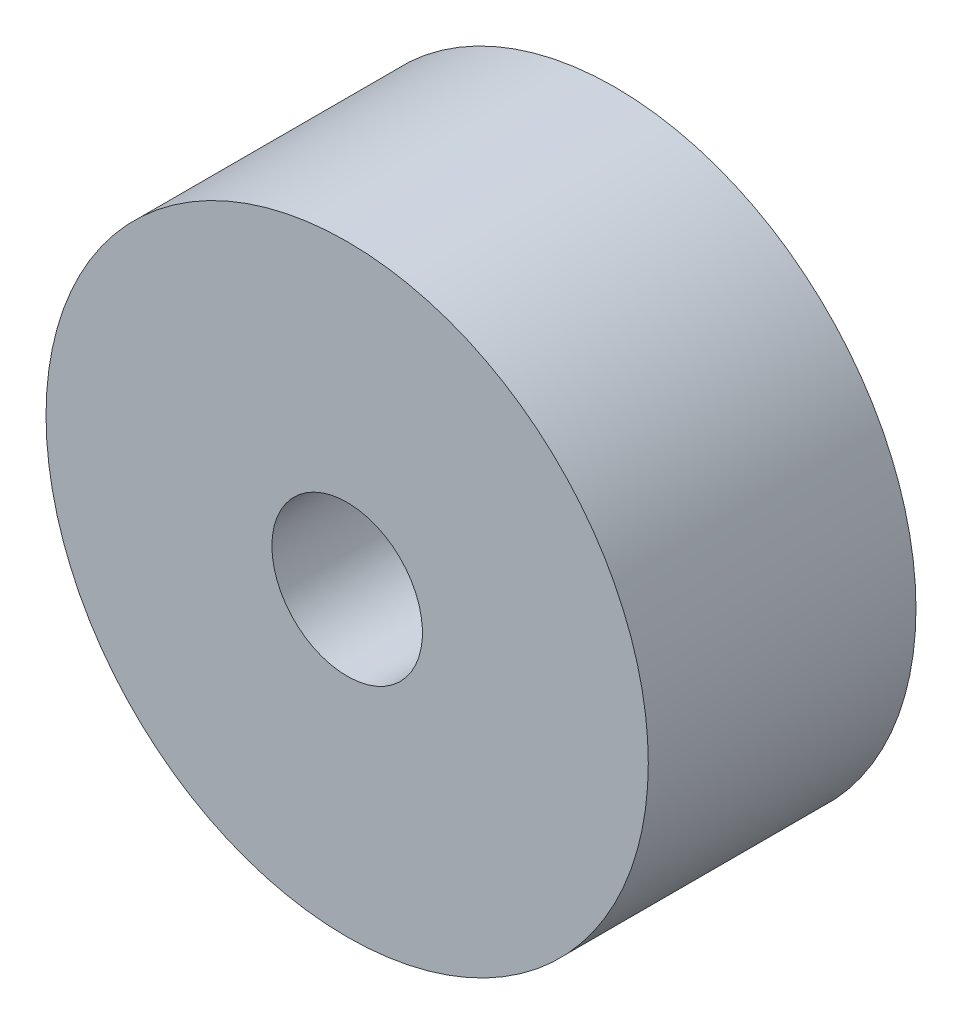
ISO-10303-21;
HEADER;
FILE_DESCRIPTION(('STEP AP214'),'2;1');
FILE_NAME('part.step','',(''),(''),'','','');
FILE_SCHEMA(('AUTOMOTIVE_DESIGN { 1 0 10303 214 1 1 1 1 }'));
ENDSEC;
DATA;
#1=APPLICATION_CONTEXT('core data for automotive mechanical design processes');
#2=APPLICATION_PROTOCOL_DEFINITION('international standard','automotive_design',2000,#1);
#3=PRODUCT_CONTEXT('',#1,'mechanical');
#4=PRODUCT('Part','Part','',(#3));
#5=PRODUCT_RELATED_PRODUCT_CATEGORY('part','',(#4));
#6=PRODUCT_DEFINITION_FORMATION('','',#4);
#7=PRODUCT_DEFINITION_CONTEXT('part definition',#1,'design');
#8=PRODUCT_DEFINITION('design','',#6,#7);
#9=PRODUCT_DEFINITION_SHAPE('','',#8);
#10=(LENGTH_UNIT() NAMED_UNIT(*) SI_UNIT(.MILLI.,.METRE.));
#11=(NAMED_UNIT(*) PLANE_ANGLE_UNIT() SI_UNIT($,.RADIAN.));
#12=(NAMED_UNIT(*) SI_UNIT($,.STERADIAN.) SOLID_ANGLE_UNIT());
#13=UNCERTAINTY_MEASURE_WITH_UNIT(LENGTH_MEASURE(1.E-05),#10,'distance_accuracy_value','');
#14=(GEOMETRIC_REPRESENTATION_CONTEXT(3) GLOBAL_UNCERTAINTY_ASSIGNED_CONTEXT((#13)) GLOBAL_UNIT_ASSIGNED_CONTEXT((#10,
#11,#12)) REPRESENTATION_CONTEXT('',''));
#15=CARTESIAN_POINT('',(0.,0.,0.));
#16=DIRECTION('',(0.,0.,1.));
#17=DIRECTION('',(1.,0.,0.));
#18=AXIS2_PLACEMENT_3D('',#15,#16,#17);
#19=CARTESIAN_POINT('',(0.,0.,8.));
#20=DIRECTION('',(0.,0.,-1.));
#21=DIRECTION('',(-1.,0.,0.));
#22=AXIS2_PLACEMENT_3D('',#19,#20,#21);
#23=CYLINDRICAL_SURFACE('',#22,9.);
#24=CARTESIAN_POINT('',(0.,0.,8.));
#25=DIRECTION('',(0.,0.,1.));
#26=DIRECTION('',(1.,0.,0.));
#27=AXIS2_PLACEMENT_3D('',#24,#25,#26);
#28=CIRCLE('',#27,9.);
#29=CARTESIAN_POINT('',(9.,0.,8.));
#30=VERTEX_POINT('',#29);
#31=EDGE_CURVE('E42',#30,#30,#28,.T.);
#32=ORIENTED_EDGE('',*,*,#31,.F.);
#33=EDGE_LOOP('',(#32));
#34=FACE_BOUND('',#33,.T.);
#35=CARTESIAN_POINT('',(0.,0.,0.));
#36=DIRECTION('',(0.,0.,1.));
#37=DIRECTION('',(1.,0.,0.));
#38=AXIS2_PLACEMENT_3D('',#35,#36,#37);
#39=CIRCLE('',#38,9.);
#40=CARTESIAN_POINT('',(9.,0.,0.));
#41=VERTEX_POINT('',#40);
#42=EDGE_CURVE('E46',#41,#41,#39,.T.);
#43=ORIENTED_EDGE('',*,*,#42,.T.);
#44=EDGE_LOOP('',(#43));
#45=FACE_BOUND('',#44,.T.);
#46=ADVANCED_FACE('F31',(#34,#45),#23,.T.);
#47=CARTESIAN_POINT('',(0.,0.,8.));
#48=DIRECTION('',(0.,0.,1.));
#49=DIRECTION('',(1.,0.,0.));
#50=AXIS2_PLACEMENT_3D('',#47,#48,#49);
#51=PLANE('',#50);
#52=CARTESIAN_POINT('',(0.,0.,8.));
#53=DIRECTION('',(0.,0.,-1.));
#54=DIRECTION('',(-1.,0.,0.));
#55=AXIS2_PLACEMENT_3D('',#52,#53,#54);
#56=CIRCLE('',#55,2.25);
#57=CARTESIAN_POINT('',(-2.25,0.,8.));
#58=VERTEX_POINT('',#57);
#59=EDGE_CURVE('E50',#58,#58,#56,.T.);
#60=ORIENTED_EDGE('',*,*,#59,.T.);
#61=EDGE_LOOP('',(#60));
#62=FACE_BOUND('',#61,.T.);
#63=ORIENTED_EDGE('',*,*,#31,.T.);
#64=EDGE_LOOP('',(#63));
#65=FACE_BOUND('',#64,.T.);
#66=ADVANCED_FACE('F55',(#62,#65),#51,.T.);
#67=CARTESIAN_POINT('',(0.,0.,0.));
#68=DIRECTION('',(0.,0.,1.));
#69=DIRECTION('',(1.,0.,0.));
#70=AXIS2_PLACEMENT_3D('',#67,#68,#69);
#71=PLANE('',#70);
#72=CARTESIAN_POINT('',(0.,0.,0.));
#73=DIRECTION('',(0.,0.,1.));
#74=DIRECTION('',(1.,0.,0.));
#75=AXIS2_PLACEMENT_3D('',#72,#73,#74);
#76=CIRCLE('',#75,4.75000000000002);
#77=CARTESIAN_POINT('',(4.75000000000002,0.,0.));
#78=VERTEX_POINT('',#77);
#79=EDGE_CURVE('E10',#78,#78,#76,.T.);
#80=ORIENTED_EDGE('',*,*,#79,.T.);
#81=EDGE_LOOP('',(#80));
#82=FACE_BOUND('',#81,.T.);
#83=ORIENTED_EDGE('',*,*,#42,.F.);
#84=EDGE_LOOP('',(#83));
#85=FACE_BOUND('',#84,.T.);
#86=ADVANCED_FACE('F60',(#82,#85),#71,.F.);
#87=CARTESIAN_POINT('',(0.,0.,8.));
#88=DIRECTION('',(0.,0.,-1.));
#89=DIRECTION('',(-1.,0.,0.));
#90=AXIS2_PLACEMENT_3D('',#87,#88,#89);
#91=CYLINDRICAL_SURFACE('',#90,2.25);
#92=CARTESIAN_POINT('',(0.,0.,2.50000000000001));
#93=DIRECTION('',(0.,0.,1.));
#94=DIRECTION('',(1.,0.,0.));
#95=AXIS2_PLACEMENT_3D('',#92,#93,#94);
#96=CIRCLE('',#95,2.25);
#97=CARTESIAN_POINT('',(2.25,0.,2.50000000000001));
#98=VERTEX_POINT('',#97);
#99=EDGE_CURVE('E38',#98,#98,#96,.F.);
#100=ORIENTED_EDGE('',*,*,#99,.T.);
#101=EDGE_LOOP('',(#100));
#102=FACE_BOUND('',#101,.T.);
#103=ORIENTED_EDGE('',*,*,#59,.F.);
#104=EDGE_LOOP('',(#103));
#105=FACE_BOUND('',#104,.T.);
#106=ADVANCED_FACE('F58',(#102,#105),#91,.F.);
#107=CARTESIAN_POINT('',(0.,0.,2.50000000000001));
#108=DIRECTION('',(0.,0.,-1.));
#109=DIRECTION('',(-1.,0.,0.));
#110=AXIS2_PLACEMENT_3D('',#107,#108,#109);
#111=CONICAL_SURFACE('',#110,2.25,0.78539816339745);
#112=ORIENTED_EDGE('',*,*,#79,.F.);
#113=EDGE_LOOP('',(#112));
#114=FACE_BOUND('',#113,.T.);
#115=ORIENTED_EDGE('',*,*,#99,.F.);
#116=EDGE_LOOP('',(#115));
#117=FACE_BOUND('',#116,.T.);
#118=ADVANCED_FACE('F33',(#114,#117),#111,.F.);
#119=CLOSED_SHELL('',(#46,#66,#86,#106,#118));
#120=MANIFOLD_SOLID_BREP('B2',#119);
#121=ADVANCED_BREP_SHAPE_REPRESENTATION('',(#18,#120),#14);
#122=SHAPE_DEFINITION_REPRESENTATION(#9,#121);
ENDSEC;
END-ISO-10303-21;
